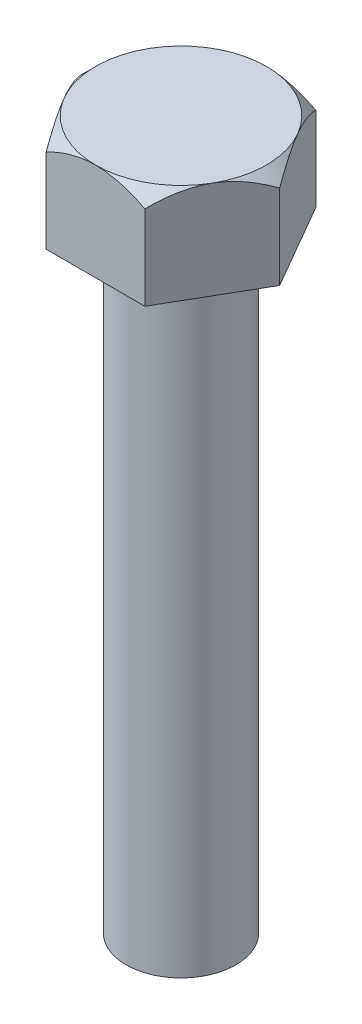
from build123d import *

# Parameters (mm, degrees)
BOSS_EXTRUDE1_DEPTH = 4
SKETCH2_R           = 2.25
BOSS_EXTRUDE2_DEPTH = 25
SKETCH3_OUTSIDE_W   = 116.264
SKETCH3_OUTSIDE_H   = 115.182
SKETCH3_OUTSIDE_R   = 3.5
CUT_EXTRUDE1_DEPTH  = 50
CUT_EXTRUDE1_DRAFT  = -45


with BuildPart() as part:
    # Sketch1 → Boss-Extrude1 (new body)
    with BuildSketch(Plane(origin=(0, 0, 0), x_dir=(1, 0, 0), z_dir=(0, 1, 0))):
        Polygon((4.041451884, 0), (2.020725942, 3.5), (-2.020725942, 3.5), (-4.041451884, 0), (-2.020725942, -3.5), (2.020725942, -3.5), align=None)
    extrude(amount=BOSS_EXTRUDE1_DEPTH)

    # Sketch2 → Boss-Extrude2 (add)
    with BuildSketch(Plane.XZ):
        with Locations(Location((0, 0, 0), (0, 0, 270))):
            Circle(SKETCH2_R)
    extrude(amount=BOSS_EXTRUDE2_DEPTH)


with BuildPart() as cut_extrude1_tool:
    # Sketch3 outside → Cut-Extrude1 (with draft: the straight prism first)
    with BuildSketch(Plane(origin=(0, 4, 0), x_dir=(1, 0, 0), z_dir=(0, 1, 0))):
        Rectangle(SKETCH3_OUTSIDE_W, SKETCH3_OUTSIDE_H)
        Circle(SKETCH3_OUTSIDE_R, mode=Mode.SUBTRACT)
    extrude(amount=-CUT_EXTRUDE1_DEPTH)
    # Cut-Extrude1: the draft: its side faces are tilted about the plane it starts from
    cut_extrude1_sides = [cut_extrude1_tool.faces().sort_by_distance(p)[0] for p in [
        (0, -21, 57.591),
        (58.132, -21, 0),
        (0, -21, -57.591),
        (-58.132, -21, 0),
        (-3.5, -21, 0),
    ]]
    draft(cut_extrude1_sides, Plane(origin=(0, 4, 0), x_dir=(1, 0, 0), z_dir=(0, 1, 0)), CUT_EXTRUDE1_DRAFT)


with BuildPart() as part_1:
    add(part.part)

    # Cut-Extrude1: cut by cut_extrude1_tool
    add(cut_extrude1_tool.part, mode=Mode.SUBTRACT)


solid = part_1.part
